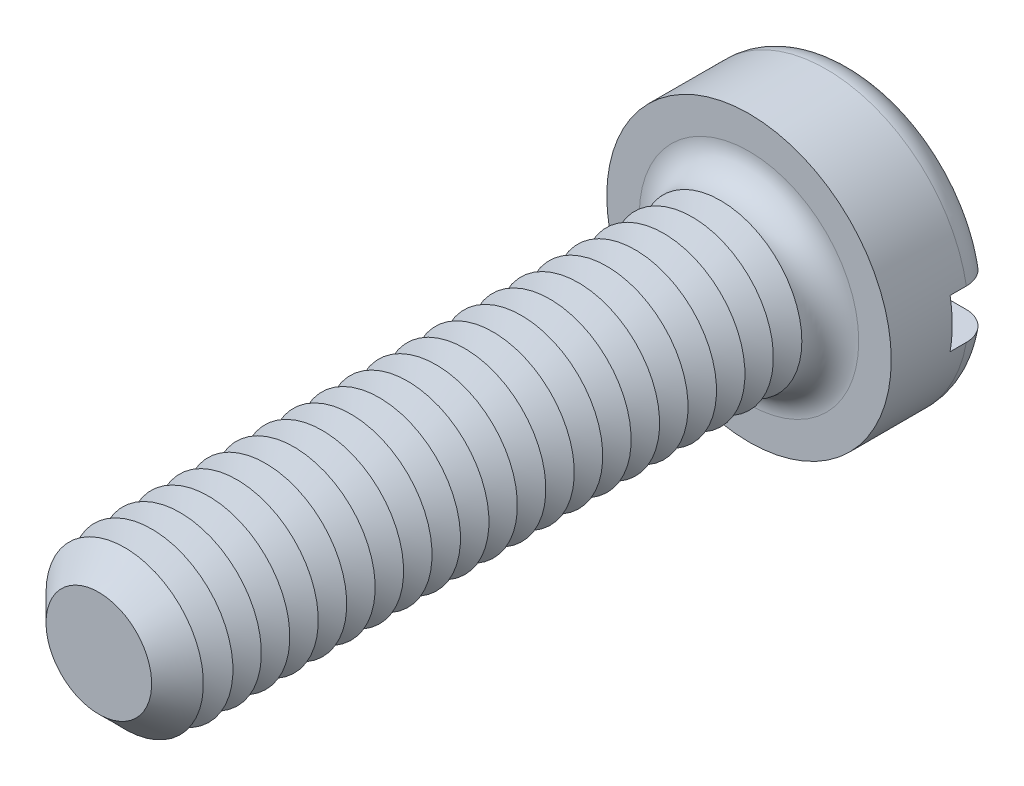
from build123d import *

# Parameters (mm, degrees)
SKETCH3_R           = 3.5
BOSS_EXTRUDE2_DEPTH = 2.6
SKETCH4_R           = 2
BOSS_EXTRUDE3_DEPTH = 16
FILLET1_R           = 0.7
CHAMFER1_SIZE       = 0.7
LPATTERN1_COUNT     = 21
LPATTERN1_PITCH     = 0.7
SKETCH8_W           = 7
SKETCH8_H           = 1.2
CUT_EXTRUDE1_DEPTH  = 1.1


with BuildPart() as part:
    # Sketch3 → Boss-Extrude2 (new body)
    with BuildSketch(Plane.XY):
        Circle(SKETCH3_R)
    extrude(amount=-BOSS_EXTRUDE2_DEPTH)

    # Sketch4 → Boss-Extrude3 (add)
    with BuildSketch(Plane.XY):
        Circle(SKETCH4_R)
    extrude(amount=BOSS_EXTRUDE3_DEPTH)

    # Fillet1
    fillet1_edges = [part.edges().sort_by_distance(p)[0] for p in [
        (-3.5, 0, -2.6),
        (-2, 0, 0),
    ]]
    fillet(fillet1_edges, radius=FILLET1_R)

    # Chamfer1
    chamfer1_edges = [part.edges().sort_by_distance(p)[0] for p in [
        (-2, 0, 16),
    ]]
    chamfer(chamfer1_edges, length=CHAMFER1_SIZE)

    # Sketch6 → Cut-Revolve1 (revolve, cut)
    with BuildSketch(Plane(origin=(0, 0, 0), x_dir=(0, 0, -1), z_dir=(1, 0, 0)), mode=Mode.PRIVATE) as cut_revolve1_sk:
        Polygon((-0.7, 2), (-1.05, 1.393782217), (-1.4, 2), align=None)
    cut_revolve1 = revolve(cut_revolve1_sk.sketch.rotate(Axis((0, 0, -1.694361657), (0, 0, 1)), 90), axis=Axis((0, 0, -1.694361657), (0, 0, 1)), mode=Mode.SUBTRACT)

    # LPattern1: Cut-Revolve1 ×21
    with Locations(*[(0, 0, i * LPATTERN1_PITCH) for i in range(1, LPATTERN1_COUNT)]):
        add(cut_revolve1, mode=Mode.SUBTRACT)

    # Sketch8 → Cut-Extrude1 (cut)
    with BuildSketch(Plane(origin=(0, 0, -2.6), x_dir=(-1, 0, 0), z_dir=(0, 0, -1))):
        Rectangle(SKETCH8_W, SKETCH8_H)
    extrude(amount=-CUT_EXTRUDE1_DEPTH, mode=Mode.SUBTRACT)


solid = part.part
